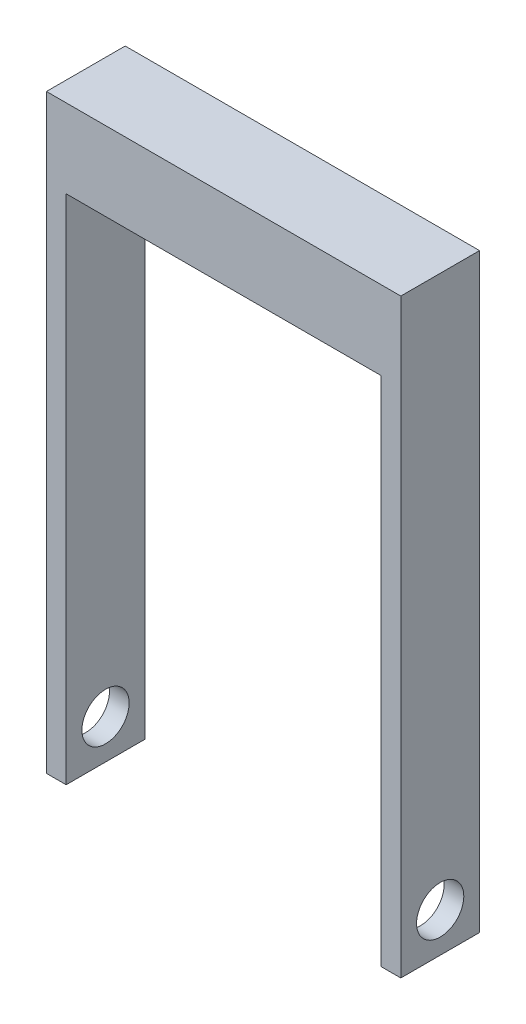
ISO-10303-21;
HEADER;
FILE_DESCRIPTION(('STEP AP214'),'2;1');
FILE_NAME('part.step','',(''),(''),'','','');
FILE_SCHEMA(('AUTOMOTIVE_DESIGN { 1 0 10303 214 1 1 1 1 }'));
ENDSEC;
DATA;
#1=APPLICATION_CONTEXT('core data for automotive mechanical design processes');
#2=APPLICATION_PROTOCOL_DEFINITION('international standard','automotive_design',2000,#1);
#3=PRODUCT_CONTEXT('',#1,'mechanical');
#4=PRODUCT('Part','Part','',(#3));
#5=PRODUCT_RELATED_PRODUCT_CATEGORY('part','',(#4));
#6=PRODUCT_DEFINITION_FORMATION('','',#4);
#7=PRODUCT_DEFINITION_CONTEXT('part definition',#1,'design');
#8=PRODUCT_DEFINITION('design','',#6,#7);
#9=PRODUCT_DEFINITION_SHAPE('','',#8);
#10=(LENGTH_UNIT() NAMED_UNIT(*) SI_UNIT(.MILLI.,.METRE.));
#11=(NAMED_UNIT(*) PLANE_ANGLE_UNIT() SI_UNIT($,.RADIAN.));
#12=(NAMED_UNIT(*) SI_UNIT($,.STERADIAN.) SOLID_ANGLE_UNIT());
#13=UNCERTAINTY_MEASURE_WITH_UNIT(LENGTH_MEASURE(1.E-05),#10,'distance_accuracy_value','');
#14=(GEOMETRIC_REPRESENTATION_CONTEXT(3) GLOBAL_UNCERTAINTY_ASSIGNED_CONTEXT((#13)) GLOBAL_UNIT_ASSIGNED_CONTEXT((#10,
#11,#12)) REPRESENTATION_CONTEXT('',''));
#15=CARTESIAN_POINT('',(0.,0.,0.));
#16=DIRECTION('',(0.,0.,1.));
#17=DIRECTION('',(1.,0.,0.));
#18=AXIS2_PLACEMENT_3D('',#15,#16,#17);
#19=CARTESIAN_POINT('',(-45.,0.,20.));
#20=DIRECTION('',(0.,1.,0.));
#21=DIRECTION('',(0.,0.,1.));
#22=AXIS2_PLACEMENT_3D('',#19,#20,#21);
#23=PLANE('',#22);
#24=DIRECTION('',(1.,0.,0.));
#25=VECTOR('',#24,1.);
#26=CARTESIAN_POINT('',(-45.,0.,0.));
#27=LINE('',#26,#25);
#28=CARTESIAN_POINT('',(-45.,0.,0.));
#29=VERTEX_POINT('',#28);
#30=CARTESIAN_POINT('',(-40.,0.,0.));
#31=VERTEX_POINT('',#30);
#32=EDGE_CURVE('E128',#29,#31,#27,.T.);
#33=ORIENTED_EDGE('',*,*,#32,.T.);
#34=DIRECTION('',(0.,0.,-1.));
#35=VECTOR('',#34,1.);
#36=CARTESIAN_POINT('',(-40.,0.,20.));
#37=LINE('',#36,#35);
#38=CARTESIAN_POINT('',(-40.,0.,20.));
#39=VERTEX_POINT('',#38);
#40=EDGE_CURVE('E11',#39,#31,#37,.T.);
#41=ORIENTED_EDGE('',*,*,#40,.F.);
#42=DIRECTION('',(1.,0.,0.));
#43=VECTOR('',#42,1.);
#44=CARTESIAN_POINT('',(-45.,0.,20.));
#45=LINE('',#44,#43);
#46=CARTESIAN_POINT('',(-45.,0.,20.));
#47=VERTEX_POINT('',#46);
#48=EDGE_CURVE('E143',#47,#39,#45,.T.);
#49=ORIENTED_EDGE('',*,*,#48,.F.);
#50=DIRECTION('',(0.,0.,-1.));
#51=VECTOR('',#50,1.);
#52=CARTESIAN_POINT('',(-45.,0.,20.));
#53=LINE('',#52,#51);
#54=EDGE_CURVE('E124',#47,#29,#53,.T.);
#55=ORIENTED_EDGE('',*,*,#54,.T.);
#56=EDGE_LOOP('',(#33,#41,#49,#55));
#57=FACE_BOUND('',#56,.T.);
#58=ADVANCED_FACE('F32',(#57),#23,.F.);
#59=CARTESIAN_POINT('',(-40.,0.,20.));
#60=DIRECTION('',(-1.,0.,0.));
#61=DIRECTION('',(0.,-1.,0.));
#62=AXIS2_PLACEMENT_3D('',#59,#60,#61);
#63=PLANE('',#62);
#64=CARTESIAN_POINT('',(-40.,9.99999999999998,10.));
#65=DIRECTION('',(-1.,0.,0.));
#66=DIRECTION('',(0.,-1.,0.));
#67=AXIS2_PLACEMENT_3D('',#64,#65,#66);
#68=CIRCLE('',#67,6.);
#69=CARTESIAN_POINT('',(-40.,3.99999999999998,10.));
#70=VERTEX_POINT('',#69);
#71=EDGE_CURVE('E132',#70,#70,#68,.T.);
#72=ORIENTED_EDGE('',*,*,#71,.T.);
#73=EDGE_LOOP('',(#72));
#74=FACE_BOUND('',#73,.T.);
#75=DIRECTION('',(0.,1.,0.));
#76=VECTOR('',#75,1.);
#77=CARTESIAN_POINT('',(-40.,0.,0.));
#78=LINE('',#77,#76);
#79=CARTESIAN_POINT('',(-40.,130.,0.));
#80=VERTEX_POINT('',#79);
#81=EDGE_CURVE('E131',#31,#80,#78,.T.);
#82=ORIENTED_EDGE('',*,*,#81,.T.);
#83=DIRECTION('',(0.,0.,-1.));
#84=VECTOR('',#83,1.);
#85=CARTESIAN_POINT('',(-40.,130.,20.));
#86=LINE('',#85,#84);
#87=CARTESIAN_POINT('',(-40.,130.,20.));
#88=VERTEX_POINT('',#87);
#89=EDGE_CURVE('E40',#88,#80,#86,.T.);
#90=ORIENTED_EDGE('',*,*,#89,.F.);
#91=DIRECTION('',(0.,1.,0.));
#92=VECTOR('',#91,1.);
#93=CARTESIAN_POINT('',(-40.,0.,20.));
#94=LINE('',#93,#92);
#95=EDGE_CURVE('E91',#39,#88,#94,.T.);
#96=ORIENTED_EDGE('',*,*,#95,.F.);
#97=ORIENTED_EDGE('',*,*,#40,.T.);
#98=EDGE_LOOP('',(#82,#90,#96,#97));
#99=FACE_BOUND('',#98,.T.);
#100=ADVANCED_FACE('F197',(#74,#99),#63,.F.);
#101=CARTESIAN_POINT('',(-40.,130.,20.));
#102=DIRECTION('',(0.,1.,0.));
#103=DIRECTION('',(0.,0.,1.));
#104=AXIS2_PLACEMENT_3D('',#101,#102,#103);
#105=PLANE('',#104);
#106=DIRECTION('',(1.,0.,0.));
#107=VECTOR('',#106,1.);
#108=CARTESIAN_POINT('',(-40.,130.,0.));
#109=LINE('',#108,#107);
#110=CARTESIAN_POINT('',(40.,130.,0.));
#111=VERTEX_POINT('',#110);
#112=EDGE_CURVE('E134',#80,#111,#109,.T.);
#113=ORIENTED_EDGE('',*,*,#112,.T.);
#114=DIRECTION('',(0.,0.,-1.));
#115=VECTOR('',#114,1.);
#116=CARTESIAN_POINT('',(40.,130.,20.));
#117=LINE('',#116,#115);
#118=CARTESIAN_POINT('',(40.,130.,20.));
#119=VERTEX_POINT('',#118);
#120=EDGE_CURVE('E150',#119,#111,#117,.T.);
#121=ORIENTED_EDGE('',*,*,#120,.F.);
#122=DIRECTION('',(1.,0.,0.));
#123=VECTOR('',#122,1.);
#124=CARTESIAN_POINT('',(-40.,130.,20.));
#125=LINE('',#124,#123);
#126=EDGE_CURVE('E158',#88,#119,#125,.T.);
#127=ORIENTED_EDGE('',*,*,#126,.F.);
#128=ORIENTED_EDGE('',*,*,#89,.T.);
#129=EDGE_LOOP('',(#113,#121,#127,#128));
#130=FACE_BOUND('',#129,.T.);
#131=ADVANCED_FACE('F156',(#130),#105,.F.);
#132=CARTESIAN_POINT('',(40.,130.,20.));
#133=DIRECTION('',(1.,0.,0.));
#134=DIRECTION('',(0.,1.,0.));
#135=AXIS2_PLACEMENT_3D('',#132,#133,#134);
#136=PLANE('',#135);
#137=CARTESIAN_POINT('',(40.,10.,10.));
#138=DIRECTION('',(1.,0.,0.));
#139=DIRECTION('',(0.,1.,0.));
#140=AXIS2_PLACEMENT_3D('',#137,#138,#139);
#141=CIRCLE('',#140,6.);
#142=CARTESIAN_POINT('',(40.,16.,10.));
#143=VERTEX_POINT('',#142);
#144=EDGE_CURVE('E178',#143,#143,#141,.T.);
#145=ORIENTED_EDGE('',*,*,#144,.T.);
#146=EDGE_LOOP('',(#145));
#147=FACE_BOUND('',#146,.T.);
#148=DIRECTION('',(0.,-1.,0.));
#149=VECTOR('',#148,1.);
#150=CARTESIAN_POINT('',(40.,130.,0.));
#151=LINE('',#150,#149);
#152=CARTESIAN_POINT('',(40.,0.,0.));
#153=VERTEX_POINT('',#152);
#154=EDGE_CURVE('E136',#111,#153,#151,.T.);
#155=ORIENTED_EDGE('',*,*,#154,.T.);
#156=DIRECTION('',(0.,0.,-1.));
#157=VECTOR('',#156,1.);
#158=CARTESIAN_POINT('',(40.,0.,20.));
#159=LINE('',#158,#157);
#160=CARTESIAN_POINT('',(40.,0.,20.));
#161=VERTEX_POINT('',#160);
#162=EDGE_CURVE('E147',#161,#153,#159,.T.);
#163=ORIENTED_EDGE('',*,*,#162,.F.);
#164=DIRECTION('',(0.,-1.,0.));
#165=VECTOR('',#164,1.);
#166=CARTESIAN_POINT('',(40.,130.,20.));
#167=LINE('',#166,#165);
#168=EDGE_CURVE('E170',#119,#161,#167,.T.);
#169=ORIENTED_EDGE('',*,*,#168,.F.);
#170=ORIENTED_EDGE('',*,*,#120,.T.);
#171=EDGE_LOOP('',(#155,#163,#169,#170));
#172=FACE_BOUND('',#171,.T.);
#173=ADVANCED_FACE('F166',(#147,#172),#136,.F.);
#174=CARTESIAN_POINT('',(40.,0.,20.));
#175=DIRECTION('',(0.,1.,0.));
#176=DIRECTION('',(-1.,0.,0.));
#177=AXIS2_PLACEMENT_3D('',#174,#175,#176);
#178=PLANE('',#177);
#179=DIRECTION('',(1.,0.,0.));
#180=VECTOR('',#179,1.);
#181=CARTESIAN_POINT('',(40.,0.,0.));
#182=LINE('',#181,#180);
#183=CARTESIAN_POINT('',(45.,0.,0.));
#184=VERTEX_POINT('',#183);
#185=EDGE_CURVE('E138',#153,#184,#182,.T.);
#186=ORIENTED_EDGE('',*,*,#185,.T.);
#187=DIRECTION('',(0.,0.,-1.));
#188=VECTOR('',#187,1.);
#189=CARTESIAN_POINT('',(45.,0.,20.));
#190=LINE('',#189,#188);
#191=CARTESIAN_POINT('',(45.,0.,20.));
#192=VERTEX_POINT('',#191);
#193=EDGE_CURVE('E119',#192,#184,#190,.T.);
#194=ORIENTED_EDGE('',*,*,#193,.F.);
#195=DIRECTION('',(1.,0.,0.));
#196=VECTOR('',#195,1.);
#197=CARTESIAN_POINT('',(40.,0.,20.));
#198=LINE('',#197,#196);
#199=EDGE_CURVE('E110',#161,#192,#198,.T.);
#200=ORIENTED_EDGE('',*,*,#199,.F.);
#201=ORIENTED_EDGE('',*,*,#162,.T.);
#202=EDGE_LOOP('',(#186,#194,#200,#201));
#203=FACE_BOUND('',#202,.T.);
#204=ADVANCED_FACE('F169',(#203),#178,.F.);
#205=CARTESIAN_POINT('',(45.,150.,20.));
#206=DIRECTION('',(-1.,0.,0.));
#207=DIRECTION('',(0.,-1.,0.));
#208=AXIS2_PLACEMENT_3D('',#205,#206,#207);
#209=PLANE('',#208);
#210=CARTESIAN_POINT('',(45.,10.,10.));
#211=DIRECTION('',(1.,0.,0.));
#212=DIRECTION('',(0.,1.,0.));
#213=AXIS2_PLACEMENT_3D('',#210,#211,#212);
#214=CIRCLE('',#213,6.);
#215=CARTESIAN_POINT('',(45.,16.,10.));
#216=VERTEX_POINT('',#215);
#217=EDGE_CURVE('E182',#216,#216,#214,.T.);
#218=ORIENTED_EDGE('',*,*,#217,.F.);
#219=EDGE_LOOP('',(#218));
#220=FACE_BOUND('',#219,.T.);
#221=DIRECTION('',(0.,1.,0.));
#222=VECTOR('',#221,1.);
#223=CARTESIAN_POINT('',(45.,150.,0.));
#224=LINE('',#223,#222);
#225=CARTESIAN_POINT('',(45.,150.,0.));
#226=VERTEX_POINT('',#225);
#227=EDGE_CURVE('E118',#184,#226,#224,.T.);
#228=ORIENTED_EDGE('',*,*,#227,.T.);
#229=DIRECTION('',(0.,0.,-1.));
#230=VECTOR('',#229,1.);
#231=CARTESIAN_POINT('',(45.,150.,20.));
#232=LINE('',#231,#230);
#233=CARTESIAN_POINT('',(45.,150.,20.));
#234=VERTEX_POINT('',#233);
#235=EDGE_CURVE('E115',#234,#226,#232,.T.);
#236=ORIENTED_EDGE('',*,*,#235,.F.);
#237=DIRECTION('',(0.,1.,0.));
#238=VECTOR('',#237,1.);
#239=CARTESIAN_POINT('',(45.,150.,20.));
#240=LINE('',#239,#238);
#241=EDGE_CURVE('E104',#192,#234,#240,.T.);
#242=ORIENTED_EDGE('',*,*,#241,.F.);
#243=ORIENTED_EDGE('',*,*,#193,.T.);
#244=EDGE_LOOP('',(#228,#236,#242,#243));
#245=FACE_BOUND('',#244,.T.);
#246=ADVANCED_FACE('F116',(#220,#245),#209,.F.);
#247=CARTESIAN_POINT('',(-45.,150.,20.));
#248=DIRECTION('',(0.,-1.,0.));
#249=DIRECTION('',(0.,0.,-1.));
#250=AXIS2_PLACEMENT_3D('',#247,#248,#249);
#251=PLANE('',#250);
#252=DIRECTION('',(-1.,0.,0.));
#253=VECTOR('',#252,1.);
#254=CARTESIAN_POINT('',(-45.,150.,0.));
#255=LINE('',#254,#253);
#256=CARTESIAN_POINT('',(-45.,150.,0.));
#257=VERTEX_POINT('',#256);
#258=EDGE_CURVE('E77',#226,#257,#255,.T.);
#259=ORIENTED_EDGE('',*,*,#258,.T.);
#260=DIRECTION('',(0.,0.,-1.));
#261=VECTOR('',#260,1.);
#262=CARTESIAN_POINT('',(-45.,150.,20.));
#263=LINE('',#262,#261);
#264=CARTESIAN_POINT('',(-45.,150.,20.));
#265=VERTEX_POINT('',#264);
#266=EDGE_CURVE('E120',#265,#257,#263,.T.);
#267=ORIENTED_EDGE('',*,*,#266,.F.);
#268=DIRECTION('',(-1.,0.,0.));
#269=VECTOR('',#268,1.);
#270=CARTESIAN_POINT('',(-45.,150.,20.));
#271=LINE('',#270,#269);
#272=EDGE_CURVE('E108',#234,#265,#271,.T.);
#273=ORIENTED_EDGE('',*,*,#272,.F.);
#274=ORIENTED_EDGE('',*,*,#235,.T.);
#275=EDGE_LOOP('',(#259,#267,#273,#274));
#276=FACE_BOUND('',#275,.T.);
#277=ADVANCED_FACE('F122',(#276),#251,.F.);
#278=CARTESIAN_POINT('',(-45.,0.,20.));
#279=DIRECTION('',(1.,0.,0.));
#280=DIRECTION('',(0.,1.,0.));
#281=AXIS2_PLACEMENT_3D('',#278,#279,#280);
#282=PLANE('',#281);
#283=CARTESIAN_POINT('',(-45.,9.99999999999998,10.));
#284=DIRECTION('',(1.,0.,0.));
#285=DIRECTION('',(0.,1.,0.));
#286=AXIS2_PLACEMENT_3D('',#283,#284,#285);
#287=CIRCLE('',#286,6.);
#288=CARTESIAN_POINT('',(-45.,16.,10.));
#289=VERTEX_POINT('',#288);
#290=EDGE_CURVE('E181',#289,#289,#287,.T.);
#291=ORIENTED_EDGE('',*,*,#290,.T.);
#292=EDGE_LOOP('',(#291));
#293=FACE_BOUND('',#292,.T.);
#294=DIRECTION('',(0.,-1.,0.));
#295=VECTOR('',#294,1.);
#296=CARTESIAN_POINT('',(-45.,0.,0.));
#297=LINE('',#296,#295);
#298=EDGE_CURVE('E83',#257,#29,#297,.T.);
#299=ORIENTED_EDGE('',*,*,#298,.T.);
#300=ORIENTED_EDGE('',*,*,#54,.F.);
#301=DIRECTION('',(0.,-1.,0.));
#302=VECTOR('',#301,1.);
#303=CARTESIAN_POINT('',(-45.,0.,20.));
#304=LINE('',#303,#302);
#305=EDGE_CURVE('E48',#265,#47,#304,.T.);
#306=ORIENTED_EDGE('',*,*,#305,.F.);
#307=ORIENTED_EDGE('',*,*,#266,.T.);
#308=EDGE_LOOP('',(#299,#300,#306,#307));
#309=FACE_BOUND('',#308,.T.);
#310=ADVANCED_FACE('F188',(#293,#309),#282,.F.);
#311=CARTESIAN_POINT('',(-40.,0.,20.));
#312=DIRECTION('',(0.,0.,1.));
#313=DIRECTION('',(1.,0.,0.));
#314=AXIS2_PLACEMENT_3D('',#311,#312,#313);
#315=PLANE('',#314);
#316=ORIENTED_EDGE('',*,*,#48,.T.);
#317=ORIENTED_EDGE('',*,*,#95,.T.);
#318=ORIENTED_EDGE('',*,*,#126,.T.);
#319=ORIENTED_EDGE('',*,*,#168,.T.);
#320=ORIENTED_EDGE('',*,*,#199,.T.);
#321=ORIENTED_EDGE('',*,*,#241,.T.);
#322=ORIENTED_EDGE('',*,*,#272,.T.);
#323=ORIENTED_EDGE('',*,*,#305,.T.);
#324=EDGE_LOOP('',(#316,#317,#318,#319,#320,#321,#322,#323));
#325=FACE_BOUND('',#324,.T.);
#326=ADVANCED_FACE('F106',(#325),#315,.T.);
#327=CARTESIAN_POINT('',(-40.,0.,0.));
#328=DIRECTION('',(0.,0.,1.));
#329=DIRECTION('',(1.,0.,0.));
#330=AXIS2_PLACEMENT_3D('',#327,#328,#329);
#331=PLANE('',#330);
#332=ORIENTED_EDGE('',*,*,#32,.F.);
#333=ORIENTED_EDGE('',*,*,#298,.F.);
#334=ORIENTED_EDGE('',*,*,#258,.F.);
#335=ORIENTED_EDGE('',*,*,#227,.F.);
#336=ORIENTED_EDGE('',*,*,#185,.F.);
#337=ORIENTED_EDGE('',*,*,#154,.F.);
#338=ORIENTED_EDGE('',*,*,#112,.F.);
#339=ORIENTED_EDGE('',*,*,#81,.F.);
#340=EDGE_LOOP('',(#332,#333,#334,#335,#336,#337,#338,#339));
#341=FACE_BOUND('',#340,.T.);
#342=ADVANCED_FACE('F162',(#341),#331,.F.);
#343=CARTESIAN_POINT('',(-45.,9.99999999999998,10.));
#344=DIRECTION('',(1.,0.,0.));
#345=DIRECTION('',(0.,1.,0.));
#346=AXIS2_PLACEMENT_3D('',#343,#344,#345);
#347=CYLINDRICAL_SURFACE('',#346,6.);
#348=ORIENTED_EDGE('',*,*,#290,.F.);
#349=EDGE_LOOP('',(#348));
#350=FACE_BOUND('',#349,.T.);
#351=ORIENTED_EDGE('',*,*,#71,.F.);
#352=EDGE_LOOP('',(#351));
#353=FACE_BOUND('',#352,.T.);
#354=ADVANCED_FACE('F190',(#350,#353),#347,.F.);
#355=ORIENTED_EDGE('',*,*,#217,.T.);
#356=EDGE_LOOP('',(#355));
#357=FACE_BOUND('',#356,.T.);
#358=ORIENTED_EDGE('',*,*,#144,.F.);
#359=EDGE_LOOP('',(#358));
#360=FACE_BOUND('',#359,.T.);
#361=ADVANCED_FACE('F193',(#357,#360),#347,.F.);
#362=CLOSED_SHELL('',(#58,#100,#131,#173,#204,#246,#277,#310,#326,#342,#354,#361));
#363=MANIFOLD_SOLID_BREP('B2',#362);
#364=ADVANCED_BREP_SHAPE_REPRESENTATION('',(#18,#363),#14);
#365=SHAPE_DEFINITION_REPRESENTATION(#9,#364);
ENDSEC;
END-ISO-10303-21;
